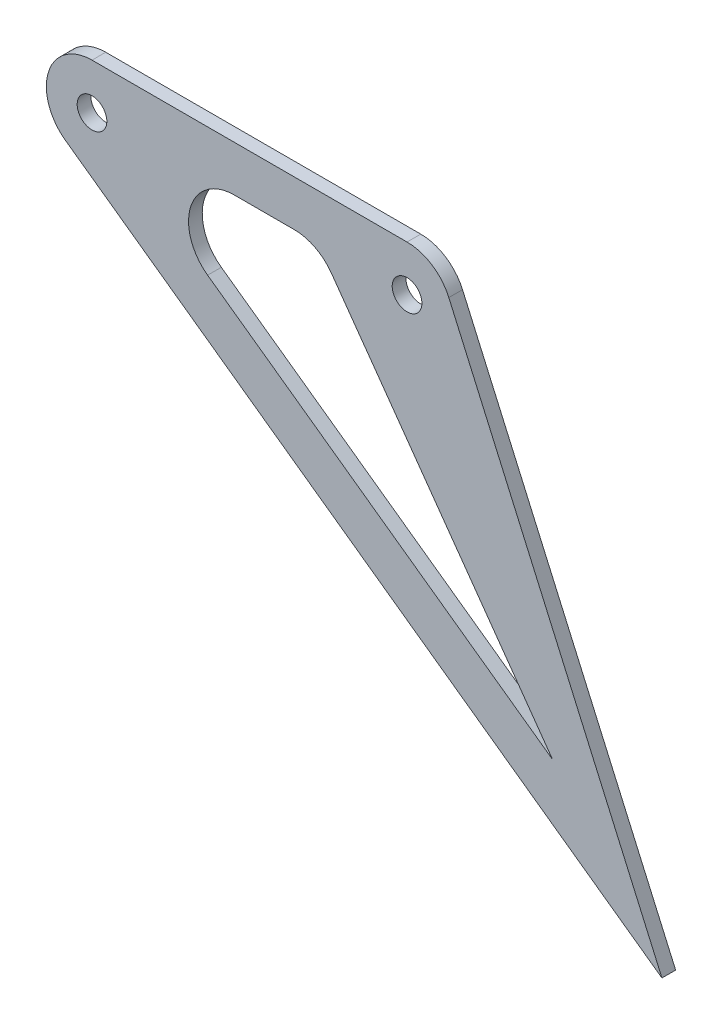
from build123d import *

# Parameters (mm, degrees)
SKETCH1_R      = 3.25
EXTRUDE1_DEPTH = 3


with BuildPart() as part:
    # Sketch1 → Extrude1 (new body)
    with BuildSketch(Plane.XY):
        with BuildLine():
            Line((0, 10), (69, 10))
            ThreePointArc((69, 10), (74.45939248, 8.378247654), (78.148028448, 4.039006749))
            Line((78.148028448, 4.039006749), (124.826086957, -101.683076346))
            Line((124.826086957, -101.683076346), (-5.821961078, -8.130483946))
            ThreePointArc((-5.821961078, -8.130483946), (-9.521156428, 3.057381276), (0, 10))
        make_face()
        with Locations((69, 0)):
            Circle(SKETCH1_R, mode=Mode.SUBTRACT)
        Circle(SKETCH1_R, mode=Mode.SUBTRACT)
        with BuildLine():
            Line((100.900049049, -72.251069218), (25.319579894, -18.130483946))
            ThreePointArc((25.319579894, -18.130483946), (21.620384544, -6.942618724), (31.141540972, 0))
            Line((31.141540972, 0), (44.296116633, 0))
            ThreePointArc((44.296116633, 0), (48.878432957, -1.111671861), (52.441942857, -4.199524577))
            Line((52.441942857, -4.199524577), (100.900049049, -72.251069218))
        make_face(mode=Mode.SUBTRACT)
    extrude(amount=EXTRUDE1_DEPTH)


solid = part.part
